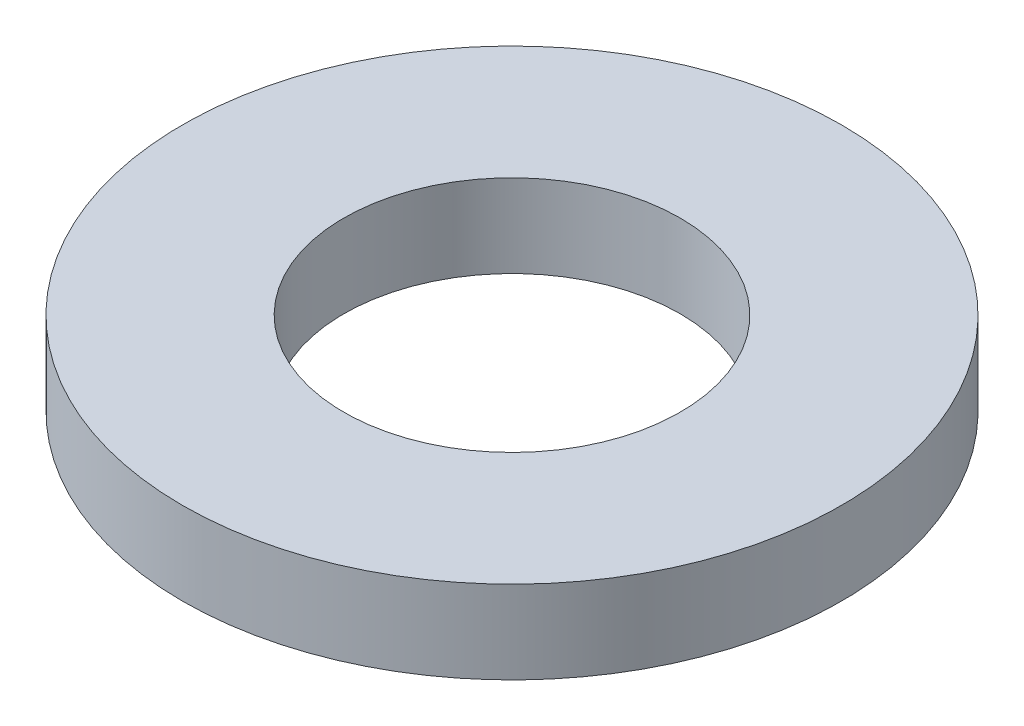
ISO-10303-21;
HEADER;
FILE_DESCRIPTION(('STEP AP214'),'2;1');
FILE_NAME('part.step','',(''),(''),'','','');
FILE_SCHEMA(('AUTOMOTIVE_DESIGN { 1 0 10303 214 1 1 1 1 }'));
ENDSEC;
DATA;
#1=APPLICATION_CONTEXT('core data for automotive mechanical design processes');
#2=APPLICATION_PROTOCOL_DEFINITION('international standard','automotive_design',2000,#1);
#3=PRODUCT_CONTEXT('',#1,'mechanical');
#4=PRODUCT('Part','Part','',(#3));
#5=PRODUCT_RELATED_PRODUCT_CATEGORY('part','',(#4));
#6=PRODUCT_DEFINITION_FORMATION('','',#4);
#7=PRODUCT_DEFINITION_CONTEXT('part definition',#1,'design');
#8=PRODUCT_DEFINITION('design','',#6,#7);
#9=PRODUCT_DEFINITION_SHAPE('','',#8);
#10=(LENGTH_UNIT() NAMED_UNIT(*) SI_UNIT(.MILLI.,.METRE.));
#11=(NAMED_UNIT(*) PLANE_ANGLE_UNIT() SI_UNIT($,.RADIAN.));
#12=(NAMED_UNIT(*) SI_UNIT($,.STERADIAN.) SOLID_ANGLE_UNIT());
#13=UNCERTAINTY_MEASURE_WITH_UNIT(LENGTH_MEASURE(1.E-05),#10,'distance_accuracy_value','');
#14=(GEOMETRIC_REPRESENTATION_CONTEXT(3) GLOBAL_UNCERTAINTY_ASSIGNED_CONTEXT((#13)) GLOBAL_UNIT_ASSIGNED_CONTEXT((#10,
#11,#12)) REPRESENTATION_CONTEXT('',''));
#15=CARTESIAN_POINT('',(0.,0.,0.));
#16=DIRECTION('',(0.,0.,1.));
#17=DIRECTION('',(1.,0.,0.));
#18=AXIS2_PLACEMENT_3D('',#15,#16,#17);
#19=CARTESIAN_POINT('',(0.,4.79425,0.));
#20=DIRECTION('',(0.,1.,0.));
#21=DIRECTION('',(0.,0.,1.));
#22=AXIS2_PLACEMENT_3D('',#19,#20,#21);
#23=PLANE('',#22);
#24=CARTESIAN_POINT('',(0.,4.79425,0.));
#25=DIRECTION('',(0.,1.,0.));
#26=DIRECTION('',(0.,0.,1.));
#27=AXIS2_PLACEMENT_3D('',#24,#25,#26);
#28=CIRCLE('',#27,19.05);
#29=CARTESIAN_POINT('',(0.,4.79425,-19.05));
#30=VERTEX_POINT('',#29);
#31=EDGE_CURVE('E10',#30,#30,#28,.T.);
#32=ORIENTED_EDGE('',*,*,#31,.T.);
#33=EDGE_LOOP('',(#32));
#34=FACE_BOUND('',#33,.T.);
#35=CARTESIAN_POINT('',(0.,4.79425,0.));
#36=DIRECTION('',(0.,1.,0.));
#37=DIRECTION('',(0.,0.,1.));
#38=AXIS2_PLACEMENT_3D('',#35,#36,#37);
#39=CIRCLE('',#38,9.7234375);
#40=CARTESIAN_POINT('',(0.,4.79425,-9.7234375));
#41=VERTEX_POINT('',#40);
#42=EDGE_CURVE('E42',#41,#41,#39,.T.);
#43=ORIENTED_EDGE('',*,*,#42,.F.);
#44=EDGE_LOOP('',(#43));
#45=FACE_BOUND('',#44,.T.);
#46=ADVANCED_FACE('F31',(#34,#45),#23,.T.);
#47=CARTESIAN_POINT('',(0.,0.,0.));
#48=DIRECTION('',(0.,1.,0.));
#49=DIRECTION('',(0.,0.,1.));
#50=AXIS2_PLACEMENT_3D('',#47,#48,#49);
#51=PLANE('',#50);
#52=CARTESIAN_POINT('',(0.,0.,0.));
#53=DIRECTION('',(0.,1.,0.));
#54=DIRECTION('',(0.,0.,1.));
#55=AXIS2_PLACEMENT_3D('',#52,#53,#54);
#56=CIRCLE('',#55,19.05);
#57=CARTESIAN_POINT('',(0.,0.,-19.05));
#58=VERTEX_POINT('',#57);
#59=EDGE_CURVE('E35',#58,#58,#56,.T.);
#60=ORIENTED_EDGE('',*,*,#59,.F.);
#61=EDGE_LOOP('',(#60));
#62=FACE_BOUND('',#61,.T.);
#63=CARTESIAN_POINT('',(0.,0.,0.));
#64=DIRECTION('',(0.,1.,0.));
#65=DIRECTION('',(0.,0.,1.));
#66=AXIS2_PLACEMENT_3D('',#63,#64,#65);
#67=CIRCLE('',#66,9.7234375);
#68=CARTESIAN_POINT('',(0.,0.,-9.7234375));
#69=VERTEX_POINT('',#68);
#70=EDGE_CURVE('E44',#69,#69,#67,.T.);
#71=ORIENTED_EDGE('',*,*,#70,.T.);
#72=EDGE_LOOP('',(#71));
#73=FACE_BOUND('',#72,.T.);
#74=ADVANCED_FACE('F54',(#62,#73),#51,.F.);
#75=CARTESIAN_POINT('',(0.,4.79425,0.));
#76=DIRECTION('',(0.,-1.,0.));
#77=DIRECTION('',(0.,0.,-1.));
#78=AXIS2_PLACEMENT_3D('',#75,#76,#77);
#79=CYLINDRICAL_SURFACE('',#78,19.05);
#80=CARTESIAN_POINT('',(0.,4.79425,-19.05));
#81=CARTESIAN_POINT('',(0.,4.74430989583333,-19.05));
#82=CARTESIAN_POINT('',(0.,4.69436979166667,-19.05));
#83=CARTESIAN_POINT('',(0.,4.59448958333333,-19.05));
#84=CARTESIAN_POINT('',(0.,4.54454947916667,-19.05));
#85=CARTESIAN_POINT('',(0.,4.44466927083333,-19.05));
#86=CARTESIAN_POINT('',(0.,4.39472916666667,-19.05));
#87=CARTESIAN_POINT('',(0.,4.29484895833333,-19.05));
#88=CARTESIAN_POINT('',(0.,4.24490885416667,-19.05));
#89=CARTESIAN_POINT('',(0.,4.14502864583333,-19.05));
#90=CARTESIAN_POINT('',(0.,4.09508854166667,-19.05));
#91=CARTESIAN_POINT('',(0.,3.99520833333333,-19.05));
#92=CARTESIAN_POINT('',(0.,3.94526822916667,-19.05));
#93=CARTESIAN_POINT('',(0.,3.84538802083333,-19.05));
#94=CARTESIAN_POINT('',(0.,3.79544791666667,-19.05));
#95=CARTESIAN_POINT('',(0.,3.69556770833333,-19.05));
#96=CARTESIAN_POINT('',(0.,3.64562760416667,-19.05));
#97=CARTESIAN_POINT('',(0.,3.54574739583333,-19.05));
#98=CARTESIAN_POINT('',(0.,3.49580729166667,-19.05));
#99=CARTESIAN_POINT('',(0.,3.39592708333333,-19.05));
#100=CARTESIAN_POINT('',(0.,3.34598697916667,-19.05));
#101=CARTESIAN_POINT('',(0.,3.24610677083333,-19.05));
#102=CARTESIAN_POINT('',(0.,3.19616666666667,-19.05));
#103=CARTESIAN_POINT('',(0.,3.09628645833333,-19.05));
#104=CARTESIAN_POINT('',(0.,3.04634635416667,-19.05));
#105=CARTESIAN_POINT('',(0.,2.94646614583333,-19.05));
#106=CARTESIAN_POINT('',(0.,2.89652604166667,-19.05));
#107=CARTESIAN_POINT('',(0.,2.79664583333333,-19.05));
#108=CARTESIAN_POINT('',(0.,2.74670572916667,-19.05));
#109=CARTESIAN_POINT('',(0.,2.64682552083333,-19.05));
#110=CARTESIAN_POINT('',(0.,2.59688541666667,-19.05));
#111=CARTESIAN_POINT('',(0.,2.49700520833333,-19.05));
#112=CARTESIAN_POINT('',(0.,2.44706510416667,-19.05));
#113=CARTESIAN_POINT('',(0.,2.34718489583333,-19.05));
#114=CARTESIAN_POINT('',(0.,2.29724479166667,-19.05));
#115=CARTESIAN_POINT('',(0.,2.19736458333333,-19.05));
#116=CARTESIAN_POINT('',(0.,2.14742447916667,-19.05));
#117=CARTESIAN_POINT('',(0.,2.04754427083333,-19.05));
#118=CARTESIAN_POINT('',(0.,1.99760416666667,-19.05));
#119=CARTESIAN_POINT('',(0.,1.89772395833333,-19.05));
#120=CARTESIAN_POINT('',(0.,1.84778385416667,-19.05));
#121=CARTESIAN_POINT('',(0.,1.74790364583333,-19.05));
#122=CARTESIAN_POINT('',(0.,1.69796354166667,-19.05));
#123=CARTESIAN_POINT('',(0.,1.59808333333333,-19.05));
#124=CARTESIAN_POINT('',(0.,1.54814322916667,-19.05));
#125=CARTESIAN_POINT('',(0.,1.44826302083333,-19.05));
#126=CARTESIAN_POINT('',(0.,1.39832291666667,-19.05));
#127=CARTESIAN_POINT('',(0.,1.29844270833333,-19.05));
#128=CARTESIAN_POINT('',(0.,1.24850260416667,-19.05));
#129=CARTESIAN_POINT('',(0.,1.14862239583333,-19.05));
#130=CARTESIAN_POINT('',(0.,1.09868229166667,-19.05));
#131=CARTESIAN_POINT('',(0.,0.998802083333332,-19.05));
#132=CARTESIAN_POINT('',(0.,0.948861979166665,-19.05));
#133=CARTESIAN_POINT('',(0.,0.848981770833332,-19.05));
#134=CARTESIAN_POINT('',(0.,0.799041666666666,-19.05));
#135=CARTESIAN_POINT('',(0.,0.699161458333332,-19.05));
#136=CARTESIAN_POINT('',(0.,0.649221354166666,-19.05));
#137=CARTESIAN_POINT('',(0.,0.549341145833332,-19.05));
#138=CARTESIAN_POINT('',(0.,0.499401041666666,-19.05));
#139=CARTESIAN_POINT('',(0.,0.399520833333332,-19.05));
#140=CARTESIAN_POINT('',(0.,0.349580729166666,-19.05));
#141=CARTESIAN_POINT('',(0.,0.249700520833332,-19.05));
#142=CARTESIAN_POINT('',(0.,0.199760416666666,-19.05));
#143=CARTESIAN_POINT('',(0.,0.0998802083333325,-19.05));
#144=CARTESIAN_POINT('',(0.,0.0499401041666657,-19.05));
#145=CARTESIAN_POINT('',(0.,0.,-19.05));
#146=B_SPLINE_CURVE_WITH_KNOTS('',3,(#80,#81,#82,#83,#84,#85,#86,#87,#88,#89,#90,#91,#92,#93,
#94,#95,#96,#97,#98,#99,#100,#101,#102,#103,#104,#105,#106,#107,#108,#109,#110,#111,#112,#113,
#114,#115,#116,#117,#118,#119,#120,#121,#122,#123,#124,#125,#126,#127,#128,#129,#130,#131,#132,
#133,#134,#135,#136,#137,#138,#139,#140,#141,#142,#143,#144,#145),.UNSPECIFIED.,.F.,.F.,(4,2,2,
2,2,2,2,2,2,2,2,2,2,2,2,2,2,2,2,2,2,2,2,2,2,2,2,2,2,2,2,2,4),(0.,0.149820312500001,
0.299640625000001,0.449460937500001,0.599281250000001,0.749101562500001,0.898921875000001,
1.0487421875,1.1985625,1.3483828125,1.498203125,1.6480234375,1.79784375,1.9476640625,
2.097484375,2.2473046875,2.397125,2.5469453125,2.696765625,2.8465859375,2.99640625,3.1462265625,
3.296046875,3.4458671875,3.5956875,3.7455078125,3.895328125,4.0451484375,4.19496875,
4.3447890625,4.494609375,4.6444296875,4.79425),.UNSPECIFIED.);
#147=EDGE_CURVE('BSEAM33',#30,#58,#146,.T.);
#148=ORIENTED_EDGE('',*,*,#31,.F.);
#149=ORIENTED_EDGE('',*,*,#59,.T.);
#150=ORIENTED_EDGE('',*,*,#147,.T.);
#151=ORIENTED_EDGE('',*,*,#147,.F.);
#152=EDGE_LOOP('',(#148,#150,#149,#151));
#153=FACE_BOUND('',#152,.T.);
#154=ADVANCED_FACE('F33',(#153),#79,.T.);
#155=CARTESIAN_POINT('',(0.,4.79425,0.));
#156=DIRECTION('',(0.,-1.,0.));
#157=DIRECTION('',(0.,0.,-1.));
#158=AXIS2_PLACEMENT_3D('',#155,#156,#157);
#159=CYLINDRICAL_SURFACE('',#158,9.7234375);
#160=CARTESIAN_POINT('',(0.,4.79425,-9.7234375));
#161=CARTESIAN_POINT('',(0.,4.74430989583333,-9.7234375));
#162=CARTESIAN_POINT('',(0.,4.69436979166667,-9.7234375));
#163=CARTESIAN_POINT('',(0.,4.59448958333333,-9.7234375));
#164=CARTESIAN_POINT('',(0.,4.54454947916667,-9.7234375));
#165=CARTESIAN_POINT('',(0.,4.44466927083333,-9.7234375));
#166=CARTESIAN_POINT('',(0.,4.39472916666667,-9.7234375));
#167=CARTESIAN_POINT('',(0.,4.29484895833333,-9.7234375));
#168=CARTESIAN_POINT('',(0.,4.24490885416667,-9.7234375));
#169=CARTESIAN_POINT('',(0.,4.14502864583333,-9.7234375));
#170=CARTESIAN_POINT('',(0.,4.09508854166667,-9.7234375));
#171=CARTESIAN_POINT('',(0.,3.99520833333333,-9.7234375));
#172=CARTESIAN_POINT('',(0.,3.94526822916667,-9.7234375));
#173=CARTESIAN_POINT('',(0.,3.84538802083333,-9.7234375));
#174=CARTESIAN_POINT('',(0.,3.79544791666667,-9.7234375));
#175=CARTESIAN_POINT('',(0.,3.69556770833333,-9.7234375));
#176=CARTESIAN_POINT('',(0.,3.64562760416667,-9.7234375));
#177=CARTESIAN_POINT('',(0.,3.54574739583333,-9.7234375));
#178=CARTESIAN_POINT('',(0.,3.49580729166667,-9.7234375));
#179=CARTESIAN_POINT('',(0.,3.39592708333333,-9.7234375));
#180=CARTESIAN_POINT('',(0.,3.34598697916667,-9.7234375));
#181=CARTESIAN_POINT('',(0.,3.24610677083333,-9.7234375));
#182=CARTESIAN_POINT('',(0.,3.19616666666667,-9.7234375));
#183=CARTESIAN_POINT('',(0.,3.09628645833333,-9.7234375));
#184=CARTESIAN_POINT('',(0.,3.04634635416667,-9.7234375));
#185=CARTESIAN_POINT('',(0.,2.94646614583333,-9.7234375));
#186=CARTESIAN_POINT('',(0.,2.89652604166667,-9.7234375));
#187=CARTESIAN_POINT('',(0.,2.79664583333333,-9.7234375));
#188=CARTESIAN_POINT('',(0.,2.74670572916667,-9.7234375));
#189=CARTESIAN_POINT('',(0.,2.64682552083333,-9.7234375));
#190=CARTESIAN_POINT('',(0.,2.59688541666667,-9.7234375));
#191=CARTESIAN_POINT('',(0.,2.49700520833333,-9.7234375));
#192=CARTESIAN_POINT('',(0.,2.44706510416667,-9.7234375));
#193=CARTESIAN_POINT('',(0.,2.34718489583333,-9.7234375));
#194=CARTESIAN_POINT('',(0.,2.29724479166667,-9.7234375));
#195=CARTESIAN_POINT('',(0.,2.19736458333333,-9.7234375));
#196=CARTESIAN_POINT('',(0.,2.14742447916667,-9.7234375));
#197=CARTESIAN_POINT('',(0.,2.04754427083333,-9.7234375));
#198=CARTESIAN_POINT('',(0.,1.99760416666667,-9.7234375));
#199=CARTESIAN_POINT('',(0.,1.89772395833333,-9.7234375));
#200=CARTESIAN_POINT('',(0.,1.84778385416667,-9.7234375));
#201=CARTESIAN_POINT('',(0.,1.74790364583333,-9.7234375));
#202=CARTESIAN_POINT('',(0.,1.69796354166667,-9.7234375));
#203=CARTESIAN_POINT('',(0.,1.59808333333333,-9.7234375));
#204=CARTESIAN_POINT('',(0.,1.54814322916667,-9.7234375));
#205=CARTESIAN_POINT('',(0.,1.44826302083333,-9.7234375));
#206=CARTESIAN_POINT('',(0.,1.39832291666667,-9.7234375));
#207=CARTESIAN_POINT('',(0.,1.29844270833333,-9.7234375));
#208=CARTESIAN_POINT('',(0.,1.24850260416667,-9.7234375));
#209=CARTESIAN_POINT('',(0.,1.14862239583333,-9.7234375));
#210=CARTESIAN_POINT('',(0.,1.09868229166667,-9.7234375));
#211=CARTESIAN_POINT('',(0.,0.998802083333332,-9.7234375));
#212=CARTESIAN_POINT('',(0.,0.948861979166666,-9.7234375));
#213=CARTESIAN_POINT('',(0.,0.848981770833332,-9.7234375));
#214=CARTESIAN_POINT('',(0.,0.799041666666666,-9.7234375));
#215=CARTESIAN_POINT('',(0.,0.699161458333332,-9.7234375));
#216=CARTESIAN_POINT('',(0.,0.649221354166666,-9.7234375));
#217=CARTESIAN_POINT('',(0.,0.549341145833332,-9.7234375));
#218=CARTESIAN_POINT('',(0.,0.499401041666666,-9.7234375));
#219=CARTESIAN_POINT('',(0.,0.399520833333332,-9.7234375));
#220=CARTESIAN_POINT('',(0.,0.349580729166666,-9.7234375));
#221=CARTESIAN_POINT('',(0.,0.249700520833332,-9.7234375));
#222=CARTESIAN_POINT('',(0.,0.199760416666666,-9.7234375));
#223=CARTESIAN_POINT('',(0.,0.0998802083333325,-9.7234375));
#224=CARTESIAN_POINT('',(0.,0.0499401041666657,-9.7234375));
#225=CARTESIAN_POINT('',(0.,0.,-9.7234375));
#226=B_SPLINE_CURVE_WITH_KNOTS('',3,(#160,#161,#162,#163,#164,#165,#166,#167,#168,#169,#170,
#171,#172,#173,#174,#175,#176,#177,#178,#179,#180,#181,#182,#183,#184,#185,#186,#187,#188,#189,
#190,#191,#192,#193,#194,#195,#196,#197,#198,#199,#200,#201,#202,#203,#204,#205,#206,#207,#208,
#209,#210,#211,#212,#213,#214,#215,#216,#217,#218,#219,#220,#221,#222,#223,#224,#225),
.UNSPECIFIED.,.F.,.F.,(4,2,2,2,2,2,2,2,2,2,2,2,2,2,2,2,2,2,2,2,2,2,2,2,2,2,2,2,2,2,2,2,4),(0.,
0.149820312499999,0.299640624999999,0.4494609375,0.599281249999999,0.749101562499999,
0.898921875,1.0487421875,1.1985625,1.3483828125,1.498203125,1.6480234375,1.79784375,
1.9476640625,2.097484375,2.2473046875,2.397125,2.5469453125,2.696765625,2.8465859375,2.99640625,
3.1462265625,3.296046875,3.4458671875,3.5956875,3.7455078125,3.895328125,4.0451484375,
4.19496875,4.3447890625,4.494609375,4.6444296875,4.79425),.UNSPECIFIED.);
#227=EDGE_CURVE('BSEAM50',#41,#69,#226,.T.);
#228=ORIENTED_EDGE('',*,*,#42,.T.);
#229=ORIENTED_EDGE('',*,*,#70,.F.);
#230=ORIENTED_EDGE('',*,*,#227,.T.);
#231=ORIENTED_EDGE('',*,*,#227,.F.);
#232=EDGE_LOOP('',(#228,#230,#229,#231));
#233=FACE_BOUND('',#232,.T.);
#234=ADVANCED_FACE('F50',(#233),#159,.F.);
#235=CLOSED_SHELL('',(#46,#74,#154,#234));
#236=MANIFOLD_SOLID_BREP('B2',#235);
#237=ADVANCED_BREP_SHAPE_REPRESENTATION('',(#18,#236),#14);
#238=SHAPE_DEFINITION_REPRESENTATION(#9,#237);
ENDSEC;
END-ISO-10303-21;
